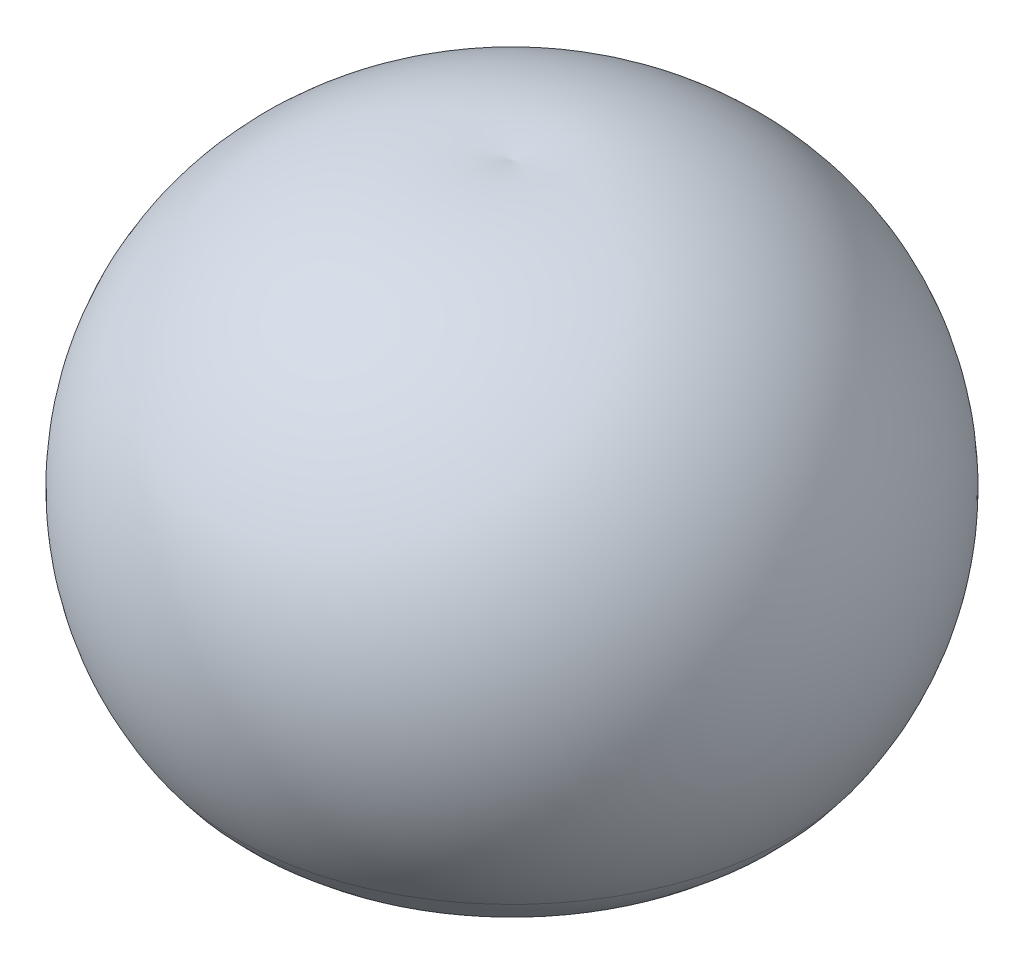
ISO-10303-21;
HEADER;
FILE_DESCRIPTION(('STEP AP214'),'2;1');
FILE_NAME('part.step','',(''),(''),'','','');
FILE_SCHEMA(('AUTOMOTIVE_DESIGN { 1 0 10303 214 1 1 1 1 }'));
ENDSEC;
DATA;
#1=APPLICATION_CONTEXT('core data for automotive mechanical design processes');
#2=APPLICATION_PROTOCOL_DEFINITION('international standard','automotive_design',2000,#1);
#3=PRODUCT_CONTEXT('',#1,'mechanical');
#4=PRODUCT('Part','Part','',(#3));
#5=PRODUCT_RELATED_PRODUCT_CATEGORY('part','',(#4));
#6=PRODUCT_DEFINITION_FORMATION('','',#4);
#7=PRODUCT_DEFINITION_CONTEXT('part definition',#1,'design');
#8=PRODUCT_DEFINITION('design','',#6,#7);
#9=PRODUCT_DEFINITION_SHAPE('','',#8);
#10=(LENGTH_UNIT() NAMED_UNIT(*) SI_UNIT(.MILLI.,.METRE.));
#11=(NAMED_UNIT(*) PLANE_ANGLE_UNIT() SI_UNIT($,.RADIAN.));
#12=(NAMED_UNIT(*) SI_UNIT($,.STERADIAN.) SOLID_ANGLE_UNIT());
#13=UNCERTAINTY_MEASURE_WITH_UNIT(LENGTH_MEASURE(1.E-05),#10,'distance_accuracy_value','');
#14=(GEOMETRIC_REPRESENTATION_CONTEXT(3) GLOBAL_UNCERTAINTY_ASSIGNED_CONTEXT((#13)) GLOBAL_UNIT_ASSIGNED_CONTEXT((#10,
#11,#12)) REPRESENTATION_CONTEXT('',''));
#15=CARTESIAN_POINT('',(0.,0.,0.));
#16=DIRECTION('',(0.,0.,1.));
#17=DIRECTION('',(1.,0.,0.));
#18=AXIS2_PLACEMENT_3D('',#15,#16,#17);
#19=CARTESIAN_POINT('',(0.,550.,0.));
#20=DIRECTION('',(0.,-1.,0.));
#21=DIRECTION('',(0.,0.,-1.));
#22=AXIS2_PLACEMENT_3D('',#19,#20,#21);
#23=DEGENERATE_TOROIDAL_SURFACE('',#22,400.,476.692320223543,.T.);
#24=CARTESIAN_POINT('',(0.,878.868787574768,0.));
#25=DIRECTION('',(0.,-1.,0.));
#26=DIRECTION('',(0.,0.,-1.));
#27=AXIS2_PLACEMENT_3D('',#24,#25,#26);
#28=CIRCLE('',#27,745.08098863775);
#29=CARTESIAN_POINT('',(0.,878.868787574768,-745.08098863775));
#30=VERTEX_POINT('',#29);
#31=EDGE_CURVE('E11',#30,#30,#28,.T.);
#32=ORIENTED_EDGE('',*,*,#31,.F.);
#33=EDGE_LOOP('',(#32));
#34=FACE_BOUND('',#33,.T.);
#35=CARTESIAN_POINT('',(0.,98.2644574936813,0.));
#36=DIRECTION('',(0.,-1.,0.));
#37=DIRECTION('',(0.,0.,-1.));
#38=AXIS2_PLACEMENT_3D('',#35,#36,#37);
#39=CIRCLE('',#38,552.218815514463);
#40=CARTESIAN_POINT('',(0.,98.2644574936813,-552.218815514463));
#41=VERTEX_POINT('',#40);
#42=EDGE_CURVE('E59',#41,#41,#39,.T.);
#43=ORIENTED_EDGE('',*,*,#42,.T.);
#44=EDGE_LOOP('',(#43));
#45=FACE_BOUND('',#44,.T.);
#46=ADVANCED_FACE('F36',(#34,#45),#23,.F.);
#47=CARTESIAN_POINT('',(0.,1175.,682.53175473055));
#48=DIRECTION('',(-1.,0.,0.));
#49=DIRECTION('',(0.,0.,-1.));
#50=AXIS2_PLACEMENT_3D('',#47,#48,#49);
#51=CIRCLE('',#50,1458.00268861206);
#52=TRIMMED_CURVE('',#51,(PARAMETER_VALUE(-1.08362529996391)),
(PARAMETER_VALUE(1.08362529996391)),.T.,.PARAMETER.);
#53=CARTESIAN_POINT('',(0.,1175.,0.));
#54=DIRECTION('',(0.,-1.,0.));
#55=AXIS1_PLACEMENT('',#53,#54);
#56=SURFACE_OF_REVOLUTION('',#52,#55);
#57=CARTESIAN_POINT('',(-2.22044604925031E-13,2463.37969705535,0.));
#58=VERTEX_POINT('',#57);
#59=VERTEX_LOOP('',#58);
#60=FACE_BOUND('',#59,.T.);
#61=ORIENTED_EDGE('',*,*,#31,.T.);
#62=EDGE_LOOP('',(#61));
#63=FACE_BOUND('',#62,.T.);
#64=ADVANCED_FACE('F49',(#60,#63),#56,.F.);
#65=CARTESIAN_POINT('',(0.,550.,-400.));
#66=DIRECTION('',(-1.,0.,0.));
#67=DIRECTION('',(0.,0.,-1.));
#68=AXIS2_PLACEMENT_3D('',#65,#66,#67);
#69=CIRCLE('',#68,2708.00268861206);
#70=TRIMMED_CURVE('',#69,(PARAMETER_VALUE(-1.71904914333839)),
(PARAMETER_VALUE(1.71904914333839)),.T.,.PARAMETER.);
#71=CARTESIAN_POINT('',(0.,550.,0.));
#72=DIRECTION('',(0.,-1.,0.));
#73=AXIS1_PLACEMENT('',#71,#72);
#74=SURFACE_OF_REVOLUTION('',#70,#73);
#75=CARTESIAN_POINT('',(0.,-1003.24653176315,0.));
#76=DIRECTION('',(0.,-1.,0.));
#77=DIRECTION('',(0.,0.,-1.));
#78=AXIS2_PLACEMENT_3D('',#75,#76,#77);
#79=CIRCLE('',#78,2618.26593831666);
#80=CARTESIAN_POINT('',(0.,-1003.24653176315,-2618.26593831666));
#81=VERTEX_POINT('',#80);
#82=EDGE_CURVE('E43',#81,#81,#79,.T.);
#83=ORIENTED_EDGE('',*,*,#82,.F.);
#84=EDGE_LOOP('',(#83));
#85=FACE_BOUND('',#84,.T.);
#86=CARTESIAN_POINT('',(0.,3228.29769845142,0.));
#87=VERTEX_POINT('',#86);
#88=VERTEX_LOOP('',#87);
#89=FACE_BOUND('',#88,.T.);
#90=ADVANCED_FACE('F52',(#85,#89),#74,.T.);
#91=CARTESIAN_POINT('',(0.,-166.970545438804,0.));
#92=DIRECTION('',(0.,-1.,0.));
#93=DIRECTION('',(0.,0.,-1.));
#94=AXIS2_PLACEMENT_3D('',#91,#92,#93);
#95=DEGENERATE_TOROIDAL_SURFACE('',#94,1423.94005536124,1458.00268861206,.T.);
#96=CARTESIAN_POINT('',(0.,-501.919737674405,0.));
#97=DIRECTION('',(0.,-1.,0.));
#98=DIRECTION('',(0.,0.,-1.));
#99=AXIS2_PLACEMENT_3D('',#96,#97,#98);
#100=CIRCLE('',#99,4.93305093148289);
#101=CARTESIAN_POINT('',(0.,-501.919737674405,-4.93305093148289));
#102=VERTEX_POINT('',#101);
#103=EDGE_CURVE('E61',#102,#102,#100,.T.);
#104=ORIENTED_EDGE('',*,*,#103,.F.);
#105=EDGE_LOOP('',(#104));
#106=FACE_BOUND('',#105,.T.);
#107=ORIENTED_EDGE('',*,*,#82,.T.);
#108=EDGE_LOOP('',(#107));
#109=FACE_BOUND('',#108,.T.);
#110=ADVANCED_FACE('F68',(#106,#109),#95,.T.);
#111=CARTESIAN_POINT('',(0.,107.484459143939,0.));
#112=DIRECTION('',(0.,-1.,0.));
#113=DIRECTION('',(0.,0.,-1.));
#114=AXIS2_PLACEMENT_3D('',#111,#112,#113);
#115=DEGENERATE_TOROIDAL_SURFACE('',#114,60.6330236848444,612.92119007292,.F.);
#116=ORIENTED_EDGE('',*,*,#42,.F.);
#117=EDGE_LOOP('',(#116));
#118=FACE_BOUND('',#117,.T.);
#119=ORIENTED_EDGE('',*,*,#103,.T.);
#120=EDGE_LOOP('',(#119));
#121=FACE_BOUND('',#120,.T.);
#122=ADVANCED_FACE('F75',(#118,#121),#115,.T.);
#123=CLOSED_SHELL('',(#46,#64,#90,#110,#122));
#124=MANIFOLD_SOLID_BREP('B2',#123);
#125=ADVANCED_BREP_SHAPE_REPRESENTATION('',(#18,#124),#14);
#126=SHAPE_DEFINITION_REPRESENTATION(#9,#125);
ENDSEC;
END-ISO-10303-21;
